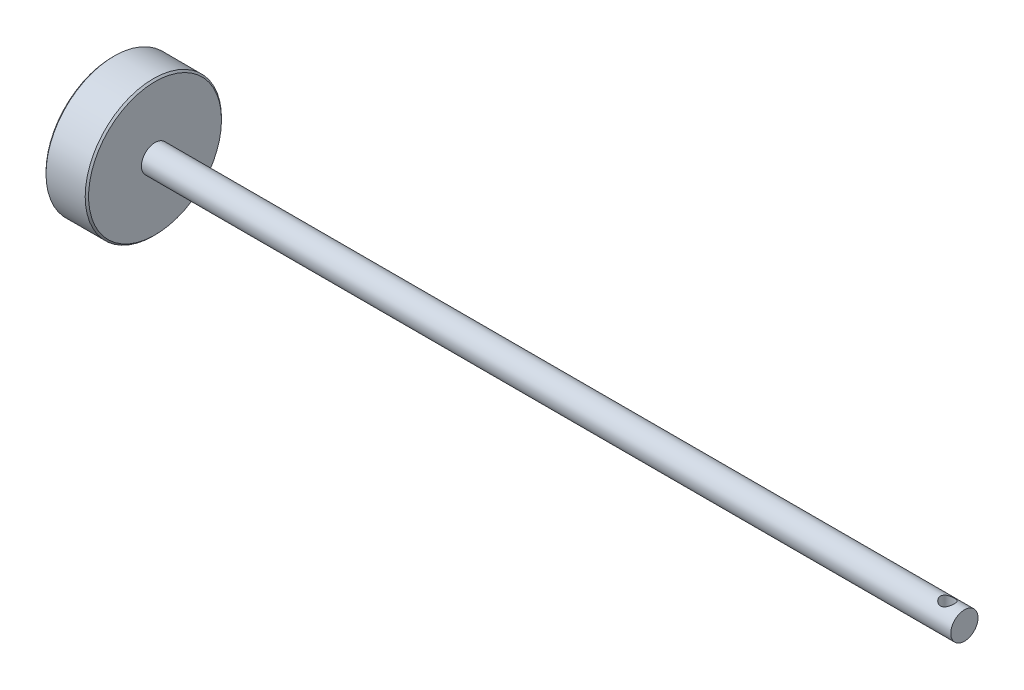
from build123d import *

# Parameters (mm, degrees)
CHANFREIN1_SIZE                     = 1
ENL_V_MAT_EXTRU_1_REACH             = 406.851
ESQUISSE2_R                         = 4
ENL_V_MAT_EXTRU_1_DIRECTION_2_DEPTH = 10


with BuildPart() as part:
    # Esquisse1 → Base-R_volution (revolve)
    with BuildSketch(Plane.XY, mode=Mode.PRIVATE) as base_r_volution_sk:
        Polygon((-375, 0), (100, 0), (100, 8), (-400, 8), (-400, -32), (-375, -32), align=None)
    revolve(base_r_volution_sk.sketch.rotate(Axis((-400, 8, 0), (1, 0, 0)), 270), axis=Axis((-400, 8, 0), (1, 0, 0)))

    # Chanfrein1
    chanfrein1_edges = [part.edges().sort_by_distance(p)[0] for p in [
        (-400, 8, -40),
        (-375, 8, -40),
    ]]
    chamfer(chanfrein1_edges, length=CHANFREIN1_SIZE)

    # Esquisse2 → Enl_v. mat.-Extru.1 (cut, up to next)
    with BuildSketch(Plane(origin=(0, 0, 0), x_dir=(1, 0, 0), z_dir=(0, 1, 0)), mode=Mode.PRIVATE) as enl_v_mat_extru_1_sk1:
        with Locations(Location((90, 0, 0), (0, 0, 90))):
            Circle(ESQUISSE2_R)
    enl_v_mat_extru_1_tool1 = extrude(enl_v_mat_extru_1_sk1.sketch, amount=ENL_V_MAT_EXTRU_1_REACH, mode=Mode.PRIVATE) & part.part
    add(enl_v_mat_extru_1_tool1.solids().sort_by_distance((90, 0, 0))[0], mode=Mode.SUBTRACT)

    # Esquisse2 → Enl_v. mat.-Extru.1 direction 2 (cut)
    with BuildSketch(Plane(origin=(0, 0, 0), x_dir=(1, 0, 0), z_dir=(0, 1, 0))):
        with Locations(Location((90, 0, 0), (0, 0, 90))):
            Circle(ESQUISSE2_R)
    extrude(amount=-ENL_V_MAT_EXTRU_1_DIRECTION_2_DEPTH, mode=Mode.SUBTRACT)


solid = part.part
